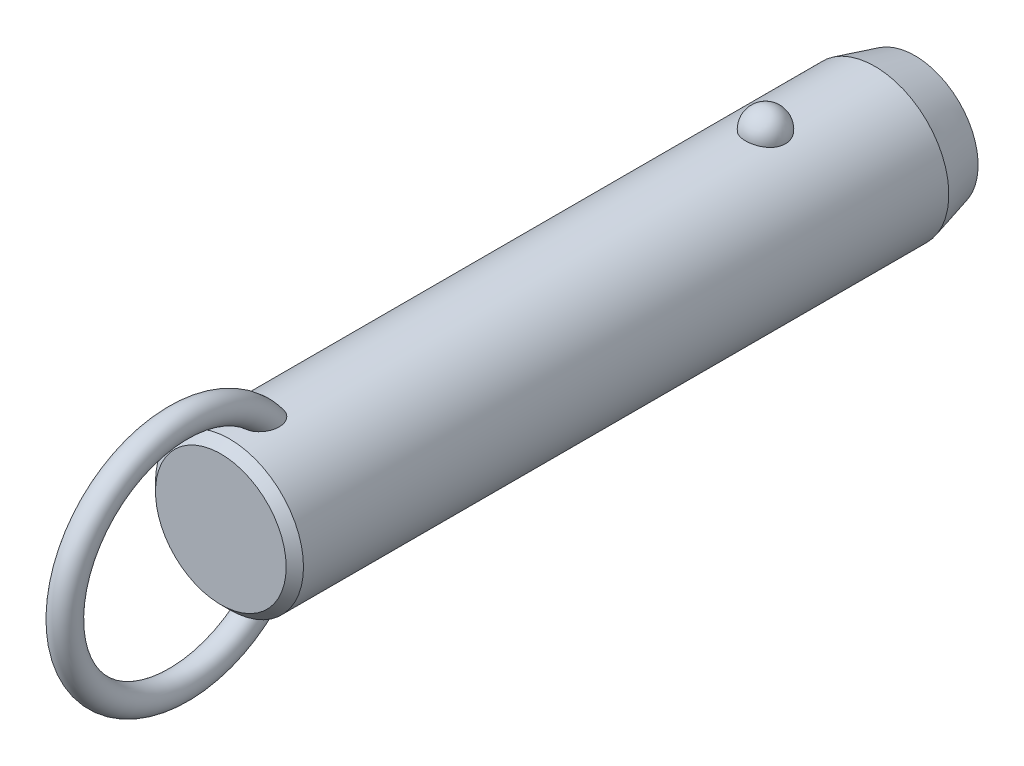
ISO-10303-21;
HEADER;
FILE_DESCRIPTION(('STEP AP214'),'2;1');
FILE_NAME('part.step','',(''),(''),'','','');
FILE_SCHEMA(('AUTOMOTIVE_DESIGN { 1 0 10303 214 1 1 1 1 }'));
ENDSEC;
DATA;
#1=APPLICATION_CONTEXT('core data for automotive mechanical design processes');
#2=APPLICATION_PROTOCOL_DEFINITION('international standard','automotive_design',2000,#1);
#3=PRODUCT_CONTEXT('',#1,'mechanical');
#4=PRODUCT('Part','Part','',(#3));
#5=PRODUCT_RELATED_PRODUCT_CATEGORY('part','',(#4));
#6=PRODUCT_DEFINITION_FORMATION('','',#4);
#7=PRODUCT_DEFINITION_CONTEXT('part definition',#1,'design');
#8=PRODUCT_DEFINITION('design','',#6,#7);
#9=PRODUCT_DEFINITION_SHAPE('','',#8);
#10=(LENGTH_UNIT() NAMED_UNIT(*) SI_UNIT(.MILLI.,.METRE.));
#11=(NAMED_UNIT(*) PLANE_ANGLE_UNIT() SI_UNIT($,.RADIAN.));
#12=(NAMED_UNIT(*) SI_UNIT($,.STERADIAN.) SOLID_ANGLE_UNIT());
#13=UNCERTAINTY_MEASURE_WITH_UNIT(LENGTH_MEASURE(1.E-05),#10,'distance_accuracy_value','');
#14=(GEOMETRIC_REPRESENTATION_CONTEXT(3) GLOBAL_UNCERTAINTY_ASSIGNED_CONTEXT((#13)) GLOBAL_UNIT_ASSIGNED_CONTEXT((#10,
#11,#12)) REPRESENTATION_CONTEXT('',''));
#15=CARTESIAN_POINT('',(0.,0.,0.));
#16=DIRECTION('',(0.,0.,1.));
#17=DIRECTION('',(1.,0.,0.));
#18=AXIS2_PLACEMENT_3D('',#15,#16,#17);
#19=CARTESIAN_POINT('',(0.,0.,66.));
#20=DIRECTION('',(0.,0.,-1.));
#21=DIRECTION('',(-1.,0.,0.));
#22=AXIS2_PLACEMENT_3D('',#19,#20,#21);
#23=CYLINDRICAL_SURFACE('',#22,11.1);
#24=CARTESIAN_POINT('',(2.9724815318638,10.6945945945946,-3.));
#25=CARTESIAN_POINT('',(2.97247830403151,10.6945972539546,-2.83225059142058));
#26=CARTESIAN_POINT('',(2.95876598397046,10.6984356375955,-2.66445972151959));
#27=CARTESIAN_POINT('',(2.90424529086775,10.7133624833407,-2.33362381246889));
#28=CARTESIAN_POINT('',(2.8634252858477,10.7244540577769,-2.1705808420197));
#29=CARTESIAN_POINT('',(2.75573657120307,10.7526272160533,-1.85396767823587));
#30=CARTESIAN_POINT('',(2.68887937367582,10.7697061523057,-1.70039333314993));
#31=CARTESIAN_POINT('',(2.53079696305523,10.8079438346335,-1.40691598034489));
#32=CARTESIAN_POINT('',(2.43957264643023,10.8291024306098,-1.2670124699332));
#33=CARTESIAN_POINT('',(2.23458150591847,10.8732541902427,-1.00409565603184));
#34=CARTESIAN_POINT('',(2.12071295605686,10.8962553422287,-0.881162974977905));
#35=CARTESIAN_POINT('',(1.87365402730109,10.9414421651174,-0.656352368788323));
#36=CARTESIAN_POINT('',(1.74046358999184,10.9636278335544,-0.554474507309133));
#37=CARTESIAN_POINT('',(1.45872188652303,11.0046495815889,-0.374872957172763));
#38=CARTESIAN_POINT('',(1.31021276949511,11.0234944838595,-0.297085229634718));
#39=CARTESIAN_POINT('',(1.00170030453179,11.0557957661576,-0.167529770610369));
#40=CARTESIAN_POINT('',(0.841698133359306,11.0692526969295,-0.115759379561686));
#41=CARTESIAN_POINT('',(0.517607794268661,11.0890932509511,-0.0403925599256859));
#42=CARTESIAN_POINT('',(0.353633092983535,11.0955916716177,-0.0163383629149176));
#43=CARTESIAN_POINT('',(0.0238420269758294,11.1011989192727,0.0044517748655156));
#44=CARTESIAN_POINT('',(-0.141974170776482,11.1003084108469,0.00119017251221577));
#45=CARTESIAN_POINT('',(-0.468405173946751,11.0912990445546,-0.0323233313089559));
#46=CARTESIAN_POINT('',(-0.629059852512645,11.0832767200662,-0.0622147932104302));
#47=CARTESIAN_POINT('',(-0.942937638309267,11.0609962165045,-0.147645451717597));
#48=CARTESIAN_POINT('',(-1.09616062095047,11.0467379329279,-0.203185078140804));
#49=CARTESIAN_POINT('',(-1.39181061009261,11.0134071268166,-0.3387529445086));
#50=CARTESIAN_POINT('',(-1.53417383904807,10.9943086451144,-0.418913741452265));
#51=CARTESIAN_POINT('',(-1.80342160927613,10.9533667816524,-0.60144882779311));
#52=CARTESIAN_POINT('',(-1.9303046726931,10.9315231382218,-0.703825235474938));
#53=CARTESIAN_POINT('',(-2.16747598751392,10.887005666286,-0.930091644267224));
#54=CARTESIAN_POINT('',(-2.27742774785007,10.8643239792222,-1.05433291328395));
#55=CARTESIAN_POINT('',(-2.47517316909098,10.8209886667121,-1.31966633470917));
#56=CARTESIAN_POINT('',(-2.56296538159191,10.8003351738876,-1.46075958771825));
#57=CARTESIAN_POINT('',(-2.71500300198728,10.7631304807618,-1.75753646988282));
#58=CARTESIAN_POINT('',(-2.77898901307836,10.7466250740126,-1.91335887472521));
#59=CARTESIAN_POINT('',(-2.88046189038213,10.7198747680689,-2.2339152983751));
#60=CARTESIAN_POINT('',(-2.91794947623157,10.709629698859,-2.39864907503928));
#61=CARTESIAN_POINT('',(-2.96537819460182,10.6965949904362,-2.73165170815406));
#62=CARTESIAN_POINT('',(-2.97542891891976,10.693775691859,-2.89990378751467));
#63=CARTESIAN_POINT('',(-2.96804271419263,10.6958279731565,-3.235752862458));
#64=CARTESIAN_POINT('',(-2.95060646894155,10.7006993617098,-3.40334987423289));
#65=CARTESIAN_POINT('',(-2.88883358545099,10.71753912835,-3.73233906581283));
#66=CARTESIAN_POINT('',(-2.84462026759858,10.7294749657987,-3.89375610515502));
#67=CARTESIAN_POINT('',(-2.73050447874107,10.7590797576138,-4.20667949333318));
#68=CARTESIAN_POINT('',(-2.66060103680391,10.7767489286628,-4.35818546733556));
#69=CARTESIAN_POINT('',(-2.49642559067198,10.8159599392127,-4.6478542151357));
#70=CARTESIAN_POINT('',(-2.40203047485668,10.8375211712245,-4.78594458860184));
#71=CARTESIAN_POINT('',(-2.19143488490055,10.8820570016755,-5.0441038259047));
#72=CARTESIAN_POINT('',(-2.07523364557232,10.9050316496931,-5.16417205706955));
#73=CARTESIAN_POINT('',(-1.82361254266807,10.9499219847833,-5.38334833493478));
#74=CARTESIAN_POINT('',(-1.68812945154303,10.9718338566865,-5.48238464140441));
#75=CARTESIAN_POINT('',(-1.40191298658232,11.0120611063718,-5.65618873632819));
#76=CARTESIAN_POINT('',(-1.25118062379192,11.0303767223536,-5.73095813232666));
#77=CARTESIAN_POINT('',(-0.940570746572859,11.0611653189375,-5.85334725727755));
#78=CARTESIAN_POINT('',(-0.780821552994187,11.0737044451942,-5.90127578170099));
#79=CARTESIAN_POINT('',(-0.455204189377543,11.0918598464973,-5.96992976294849));
#80=CARTESIAN_POINT('',(-0.289336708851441,11.0974768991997,-5.99065827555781));
#81=CARTESIAN_POINT('',(0.0406846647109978,11.1011307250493,-6.00418773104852));
#82=CARTESIAN_POINT('',(0.204817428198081,11.099299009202,-5.99747318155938));
#83=CARTESIAN_POINT('',(0.5295530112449,11.088551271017,-5.9574031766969));
#84=CARTESIAN_POINT('',(0.69015594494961,11.0796354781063,-5.92404858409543));
#85=CARTESIAN_POINT('',(1.0027760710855,11.0557204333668,-5.83180084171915));
#86=CARTESIAN_POINT('',(1.15482001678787,11.0407414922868,-5.77299291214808));
#87=CARTESIAN_POINT('',(1.44678373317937,11.0062913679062,-5.63147366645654));
#88=CARTESIAN_POINT('',(1.58670279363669,10.9868199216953,-5.54876095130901));
#89=CARTESIAN_POINT('',(1.8527023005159,10.9451315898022,-5.36027644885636));
#90=CARTESIAN_POINT('',(1.97855158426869,10.9228788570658,-5.25418644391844));
#91=CARTESIAN_POINT('',(2.21080872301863,10.8782509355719,-5.02251354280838));
#92=CARTESIAN_POINT('',(2.31721312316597,10.8558757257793,-4.89692718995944));
#93=CARTESIAN_POINT('',(2.5094551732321,10.8130715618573,-4.62745408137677));
#94=CARTESIAN_POINT('',(2.59493284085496,10.7926798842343,-4.48330448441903));
#95=CARTESIAN_POINT('',(2.740862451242,10.7565495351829,-4.18236358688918));
#96=CARTESIAN_POINT('',(2.80132490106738,10.7408089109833,-4.02557762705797));
#97=CARTESIAN_POINT('',(2.88959070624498,10.7173718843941,-3.72475308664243));
#98=CARTESIAN_POINT('',(2.92062102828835,10.7088950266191,-3.58171216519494));
#99=CARTESIAN_POINT('',(2.96206765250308,10.6975052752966,-3.29245795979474));
#100=CARTESIAN_POINT('',(2.97248434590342,10.6945922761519,-3.14624473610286));
#101=CARTESIAN_POINT('',(2.9724815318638,10.6945945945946,-3.));
#102=B_SPLINE_CURVE_WITH_KNOTS('',3,(#24,#25,#26,#27,#28,#29,#30,#31,#32,#33,#34,#35,#36,#37,
#38,#39,#40,#41,#42,#43,#44,#45,#46,#47,#48,#49,#50,#51,#52,#53,#54,#55,#56,#57,#58,#59,#60,#61,
#62,#63,#64,#65,#66,#67,#68,#69,#70,#71,#72,#73,#74,#75,#76,#77,#78,#79,#80,#81,#82,#83,#84,#85,
#86,#87,#88,#89,#90,#91,#92,#93,#94,#95,#96,#97,#98,#99,#100,#101),.UNSPECIFIED.,.T.,.F.,(4,2,2,
2,2,2,2,2,2,2,2,2,2,2,2,2,2,2,2,2,2,2,2,2,2,2,2,2,2,2,2,2,2,2,2,2,2,2,4),(0.,0.502722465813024,
1.00566079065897,1.5083769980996,2.01107471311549,2.51608392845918,3.02109467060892,
3.52475118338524,4.02835620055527,4.523518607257,5.0186364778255,5.50715297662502,
5.9956776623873,6.48688002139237,6.97812923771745,7.47814366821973,7.9781907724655,
8.48353712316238,8.9888697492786,9.49218093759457,9.99547960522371,10.4964777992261,
10.997494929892,11.5010810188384,12.0046847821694,12.5099796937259,13.0152411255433,
13.5145635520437,14.0138298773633,14.5043200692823,14.9947943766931,15.4836390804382,
15.9725123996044,16.4685040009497,16.9645836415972,17.4686765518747,17.972557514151,
18.410841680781,18.849117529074),.UNSPECIFIED.);
#103=CARTESIAN_POINT('',(2.9724815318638,10.6945945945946,-3.));
#104=VERTEX_POINT('',#103);
#105=EDGE_CURVE('E41',#104,#104,#102,.T.);
#106=ORIENTED_EDGE('',*,*,#105,.T.);
#107=EDGE_LOOP('',(#106));
#108=FACE_BOUND('',#107,.T.);
#109=CARTESIAN_POINT('',(0.,0.,77.4));
#110=DIRECTION('',(0.,0.,1.));
#111=DIRECTION('',(1.,0.,0.));
#112=AXIS2_PLACEMENT_3D('',#109,#110,#111);
#113=CIRCLE('',#112,11.1);
#114=CARTESIAN_POINT('',(11.1,0.,77.4));
#115=VERTEX_POINT('',#114);
#116=EDGE_CURVE('E10',#115,#115,#113,.F.);
#117=ORIENTED_EDGE('',*,*,#116,.T.);
#118=EDGE_LOOP('',(#117));
#119=FACE_BOUND('',#118,.T.);
#120=CARTESIAN_POINT('',(-0.564520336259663,-11.0856356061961,69.6578154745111));
#121=CARTESIAN_POINT('',(-0.667202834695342,-11.0804062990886,69.6912839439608));
#122=CARTESIAN_POINT('',(-0.766875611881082,-11.0738877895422,69.7338357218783));
#123=CARTESIAN_POINT('',(-0.957284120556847,-11.0590576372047,69.8354190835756));
#124=CARTESIAN_POINT('',(-1.04801616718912,-11.0507452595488,69.8944574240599));
#125=CARTESIAN_POINT('',(-1.21800952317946,-11.0333016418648,70.0265293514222));
#126=CARTESIAN_POINT('',(-1.29730805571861,-11.0241732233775,70.0995156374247));
#127=CARTESIAN_POINT('',(-1.44337665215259,-11.0060026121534,70.2570374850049));
#128=CARTESIAN_POINT('',(-1.51014622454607,-10.9969604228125,70.3415734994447));
#129=CARTESIAN_POINT('',(-1.63454620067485,-10.9791841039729,70.5255213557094));
#130=CARTESIAN_POINT('',(-1.69127003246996,-10.9705107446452,70.6255493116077));
#131=CARTESIAN_POINT('',(-1.78980785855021,-10.9548648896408,70.8327902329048));
#132=CARTESIAN_POINT('',(-1.83161214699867,-10.9478935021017,70.9400078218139));
#133=CARTESIAN_POINT('',(-1.91557028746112,-10.9335803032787,71.2054080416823));
#134=CARTESIAN_POINT('',(-1.95040620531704,-10.9273269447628,71.3659806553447));
#135=CARTESIAN_POINT('',(-1.99388326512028,-10.9194709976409,71.6906977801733));
#136=CARTESIAN_POINT('',(-2.00248051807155,-10.9178762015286,71.8548478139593));
#137=CARTESIAN_POINT('',(-1.99551615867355,-10.9191578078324,72.2246504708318));
#138=CARTESIAN_POINT('',(-1.9732206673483,-10.9232807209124,72.4301911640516));
#139=CARTESIAN_POINT('',(-1.91529761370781,-10.9335244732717,72.733595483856));
#140=CARTESIAN_POINT('',(-1.8918457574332,-10.9376266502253,72.8340883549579));
#141=CARTESIAN_POINT('',(-1.83700674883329,-10.9469720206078,73.032855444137));
#142=CARTESIAN_POINT('',(-1.80562070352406,-10.9522150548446,73.1311299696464));
#143=CARTESIAN_POINT('',(-1.73463055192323,-10.9636837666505,73.3259148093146));
#144=CARTESIAN_POINT('',(-1.69493416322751,-10.9699202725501,73.4223907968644));
#145=CARTESIAN_POINT('',(-1.60745141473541,-10.9830806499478,73.6116262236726));
#146=CARTESIAN_POINT('',(-1.55966150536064,-10.9900048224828,73.7043840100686));
#147=CARTESIAN_POINT('',(-1.45591812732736,-11.0042280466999,73.8846907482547));
#148=CARTESIAN_POINT('',(-1.40000013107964,-11.0115253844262,73.9722601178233));
#149=CARTESIAN_POINT('',(-1.27937470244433,-11.0261911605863,74.1410298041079));
#150=CARTESIAN_POINT('',(-1.21467835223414,-11.0335594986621,74.2222379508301));
#151=CARTESIAN_POINT('',(-1.08218150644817,-11.0473027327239,74.3690010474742));
#152=CARTESIAN_POINT('',(-1.01522633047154,-11.0537063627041,74.435309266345));
#153=CARTESIAN_POINT('',(-0.87295215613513,-11.065850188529,74.5583780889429));
#154=CARTESIAN_POINT('',(-0.797642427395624,-11.0715911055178,74.6151491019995));
#155=CARTESIAN_POINT('',(-0.651396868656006,-11.081071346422,74.7075155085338));
#156=CARTESIAN_POINT('',(-0.581712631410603,-11.0849841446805,74.7450491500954));
#157=CARTESIAN_POINT('',(-0.437066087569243,-11.0916271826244,74.8082594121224));
#158=CARTESIAN_POINT('',(-0.362109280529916,-11.0943586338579,74.8339481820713));
#159=CARTESIAN_POINT('',(-0.207828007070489,-11.0983242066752,74.871117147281));
#160=CARTESIAN_POINT('',(-0.128467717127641,-11.0995432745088,74.8824545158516));
#161=CARTESIAN_POINT('',(0.0309101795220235,-11.1002423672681,74.8889658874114));
#162=CARTESIAN_POINT('',(0.110927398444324,-11.0997233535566,74.8841488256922));
#163=CARTESIAN_POINT('',(0.256406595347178,-11.097240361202,74.8609599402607));
#164=CARTESIAN_POINT('',(0.32223577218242,-11.0955074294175,74.8447543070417));
#165=CARTESIAN_POINT('',(0.450635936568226,-11.0910350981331,74.8026008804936));
#166=CARTESIAN_POINT('',(0.513205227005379,-11.0882951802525,74.7766480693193));
#167=CARTESIAN_POINT('',(0.662626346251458,-11.0805620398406,74.7026073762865));
#168=CARTESIAN_POINT('',(0.747127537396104,-11.0751144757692,74.6498452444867));
#169=CARTESIAN_POINT('',(0.906756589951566,-11.0631932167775,74.5317206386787));
#170=CARTESIAN_POINT('',(0.981859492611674,-11.0567168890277,74.4663257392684));
#171=CARTESIAN_POINT('',(1.10712207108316,-11.0447856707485,74.3422633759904));
#172=CARTESIAN_POINT('',(1.15909566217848,-11.0394280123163,74.2853831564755));
#173=CARTESIAN_POINT('',(1.25791923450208,-11.0286040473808,74.1673271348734));
#174=CARTESIAN_POINT('',(1.30476642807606,-11.0231376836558,74.1061490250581));
#175=CARTESIAN_POINT('',(1.43818612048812,-11.0068027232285,73.9173051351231));
#176=CARTESIAN_POINT('',(1.51751767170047,-10.9960104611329,73.7844531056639));
#177=CARTESIAN_POINT('',(1.63597546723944,-10.9788847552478,73.5531371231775));
#178=CARTESIAN_POINT('',(1.67988876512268,-10.9722190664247,73.4570530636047));
#179=CARTESIAN_POINT('',(1.75953241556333,-10.9597298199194,73.2614311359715));
#180=CARTESIAN_POINT('',(1.79525967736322,-10.9539065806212,73.1618919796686));
#181=CARTESIAN_POINT('',(1.85844731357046,-10.9433632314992,72.9602111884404));
#182=CARTESIAN_POINT('',(1.88591073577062,-10.9386427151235,72.8580705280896));
#183=CARTESIAN_POINT('',(1.93234324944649,-10.9305350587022,72.6518191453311));
#184=CARTESIAN_POINT('',(1.95131065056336,-10.9271481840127,72.5477080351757));
#185=CARTESIAN_POINT('',(1.99040203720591,-10.9201183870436,72.2654588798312));
#186=CARTESIAN_POINT('',(2.00221217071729,-10.9179256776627,72.0860370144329));
#187=CARTESIAN_POINT('',(1.99711676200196,-10.9188636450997,71.7277133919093));
#188=CARTESIAN_POINT('',(1.98026150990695,-10.9219849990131,71.548811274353));
#189=CARTESIAN_POINT('',(1.92151657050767,-10.9324473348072,71.2364514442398));
#190=CARTESIAN_POINT('',(1.88605081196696,-10.9386915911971,71.1017594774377));
#191=CARTESIAN_POINT('',(1.7939302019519,-10.9541780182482,70.8399669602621));
#192=CARTESIAN_POINT('',(1.73729868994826,-10.9634168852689,70.7128582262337));
#193=CARTESIAN_POINT('',(1.612370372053,-10.9824218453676,70.4894184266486));
#194=CARTESIAN_POINT('',(1.54715374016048,-10.9918945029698,70.3913455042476));
#195=CARTESIAN_POINT('',(1.40127026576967,-11.0114415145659,70.2074341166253));
#196=CARTESIAN_POINT('',(1.32060742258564,-11.0215157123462,70.1215924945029));
#197=CARTESIAN_POINT('',(1.14474787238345,-11.041168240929,69.9651630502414));
#198=CARTESIAN_POINT('',(1.04947805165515,-11.0507437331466,69.8946565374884));
#199=CARTESIAN_POINT('',(0.847278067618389,-11.0680789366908,69.772640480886));
#200=CARTESIAN_POINT('',(0.740351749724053,-11.0758392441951,69.7211246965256));
#201=CARTESIAN_POINT('',(0.529289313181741,-11.0878275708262,69.6434852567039));
#202=CARTESIAN_POINT('',(0.425895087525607,-11.0923259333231,69.615377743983));
#203=CARTESIAN_POINT('',(0.215723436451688,-11.0984001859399,69.5777038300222));
#204=CARTESIAN_POINT('',(0.108947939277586,-11.0999777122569,69.5681270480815));
#205=CARTESIAN_POINT('',(-0.0938962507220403,-11.1000196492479,69.5678773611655));
#206=CARTESIAN_POINT('',(-0.189967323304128,-11.0987797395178,69.5754089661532));
#207=CARTESIAN_POINT('',(-0.379657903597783,-11.0939111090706,69.6055079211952));
#208=CARTESIAN_POINT('',(-0.473277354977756,-11.0902823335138,69.6280756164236));
#209=CARTESIAN_POINT('',(-0.564520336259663,-11.0856356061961,69.6578154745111));
#210=B_SPLINE_CURVE_WITH_KNOTS('',3,(#120,#121,#122,#123,#124,#125,#126,#127,#128,#129,#130,
#131,#132,#133,#134,#135,#136,#137,#138,#139,#140,#141,#142,#143,#144,#145,#146,#147,#148,#149,
#150,#151,#152,#153,#154,#155,#156,#157,#158,#159,#160,#161,#162,#163,#164,#165,#166,#167,#168,
#169,#170,#171,#172,#173,#174,#175,#176,#177,#178,#179,#180,#181,#182,#183,#184,#185,#186,#187,
#188,#189,#190,#191,#192,#193,#194,#195,#196,#197,#198,#199,#200,#201,#202,#203,#204,#205,#206,
#207,#208,#209),.UNSPECIFIED.,.T.,.F.,(4,2,2,2,2,2,2,2,2,2,2,2,2,2,2,2,2,2,2,2,2,2,2,2,2,2,2,2,
2,2,2,2,2,2,2,2,2,2,2,2,2,2,2,2,4),(0.,0.323999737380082,0.648132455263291,0.971184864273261,
1.29424994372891,1.6388623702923,1.98369857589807,2.47426059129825,2.96564271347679,
3.58257396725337,3.89215258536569,4.20168803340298,4.51486273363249,4.82817514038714,
5.14015911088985,5.45175282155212,5.73442856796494,6.01679375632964,6.25364580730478,
6.49025437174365,6.7291996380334,6.96801276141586,7.17061258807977,7.37331685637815,
7.67094989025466,7.96935728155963,8.2007506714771,8.43226927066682,8.89581623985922,
9.21306533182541,9.53043400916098,9.84768549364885,10.1650000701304,10.70229304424,
11.2386443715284,11.6553390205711,12.0715755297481,12.4245637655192,12.7774607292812,
13.1321855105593,13.4867936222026,13.8068771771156,14.1267813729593,14.4146787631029,
14.7025827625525),.UNSPECIFIED.);
#211=CARTESIAN_POINT('',(-0.564520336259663,-11.0856356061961,69.6578154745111));
#212=VERTEX_POINT('',#211);
#213=EDGE_CURVE('E59',#212,#212,#210,.T.);
#214=ORIENTED_EDGE('',*,*,#213,.T.);
#215=EDGE_LOOP('',(#214));
#216=FACE_BOUND('',#215,.T.);
#217=CARTESIAN_POINT('',(-0.564520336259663,11.0856356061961,69.6578154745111));
#218=CARTESIAN_POINT('',(-0.468542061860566,11.0905203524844,69.6265456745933));
#219=CARTESIAN_POINT('',(-0.36979381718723,11.0942886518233,69.6031576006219));
#220=CARTESIAN_POINT('',(-0.169555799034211,11.0991586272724,69.5730858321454));
#221=CARTESIAN_POINT('',(-0.0680604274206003,11.1002543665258,69.5664393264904));
#222=CARTESIAN_POINT('',(0.134549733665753,11.099646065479,69.5701579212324));
#223=CARTESIAN_POINT('',(0.235664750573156,11.0979441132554,69.5805103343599));
#224=CARTESIAN_POINT('',(0.43463240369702,11.0919342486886,69.6178318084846));
#225=CARTESIAN_POINT('',(0.532486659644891,11.0876276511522,69.6447924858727));
#226=CARTESIAN_POINT('',(0.722445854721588,11.0768742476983,69.7144096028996));
#227=CARTESIAN_POINT('',(0.814543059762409,11.0704246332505,69.7570866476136));
#228=CARTESIAN_POINT('',(0.99056508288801,11.0560659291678,69.8566487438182));
#229=CARTESIAN_POINT('',(1.07448844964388,11.048156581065,69.9135363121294));
#230=CARTESIAN_POINT('',(1.23562672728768,11.0313221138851,70.0422106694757));
#231=CARTESIAN_POINT('',(1.31242684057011,11.0223686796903,70.1145117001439));
#232=CARTESIAN_POINT('',(1.45398030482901,11.0045918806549,70.2700425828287));
#233=CARTESIAN_POINT('',(1.51873073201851,10.9957685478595,70.3532750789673));
#234=CARTESIAN_POINT('',(1.64107232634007,10.9782087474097,70.5363842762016));
#235=CARTESIAN_POINT('',(1.69743176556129,10.9695572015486,70.6370893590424));
#236=CARTESIAN_POINT('',(1.79515063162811,10.9539887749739,70.8456264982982));
#237=CARTESIAN_POINT('',(1.83649966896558,10.9470730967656,70.9534634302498));
#238=CARTESIAN_POINT('',(1.91931148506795,10.9329211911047,71.2203995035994));
#239=CARTESIAN_POINT('',(1.9534010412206,10.9267904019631,71.3818612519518));
#240=CARTESIAN_POINT('',(1.99526195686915,10.9192174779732,71.7082163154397));
#241=CARTESIAN_POINT('',(2.00298989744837,10.9177830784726,71.8731148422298));
#242=CARTESIAN_POINT('',(1.99396251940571,10.9194420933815,72.2441006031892));
#243=CARTESIAN_POINT('',(1.97050829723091,10.923774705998,72.4500387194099));
#244=CARTESIAN_POINT('',(1.91079643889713,10.9343131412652,72.7539019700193));
#245=CARTESIAN_POINT('',(1.88673702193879,10.9385106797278,72.8545296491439));
#246=CARTESIAN_POINT('',(1.83065508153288,10.9480376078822,73.0535107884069));
#247=CARTESIAN_POINT('',(1.79863369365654,10.9533668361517,73.151864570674));
#248=CARTESIAN_POINT('',(1.72633365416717,10.9649954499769,73.346720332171));
#249=CARTESIAN_POINT('',(1.68596409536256,10.9713053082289,73.4431879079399));
#250=CARTESIAN_POINT('',(1.59707998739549,10.9845964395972,73.6323233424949));
#251=CARTESIAN_POINT('',(1.54856169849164,10.9915780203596,73.7249894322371));
#252=CARTESIAN_POINT('',(1.44330168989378,11.0058935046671,73.9049752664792));
#253=CARTESIAN_POINT('',(1.38659749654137,11.0132257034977,73.992316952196));
#254=CARTESIAN_POINT('',(1.26431158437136,11.0279330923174,74.1604563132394));
#255=CARTESIAN_POINT('',(1.19874160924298,11.0353082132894,74.2412624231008));
#256=CARTESIAN_POINT('',(1.06542088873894,11.048931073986,74.3859856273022));
#257=CARTESIAN_POINT('',(0.998640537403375,11.0552153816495,74.450784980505));
#258=CARTESIAN_POINT('',(0.856896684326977,11.0671032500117,74.5708462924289));
#259=CARTESIAN_POINT('',(0.781942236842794,11.0727075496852,74.6261186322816));
#260=CARTESIAN_POINT('',(0.636276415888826,11.081949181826,74.7159721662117));
#261=CARTESIAN_POINT('',(0.566755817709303,11.0857572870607,74.7524410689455));
#262=CARTESIAN_POINT('',(0.422602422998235,11.0921860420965,74.8135333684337));
#263=CARTESIAN_POINT('',(0.347974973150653,11.0948079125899,74.8381689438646));
#264=CARTESIAN_POINT('',(0.194593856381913,11.0985608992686,74.8733233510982));
#265=CARTESIAN_POINT('',(0.115807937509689,11.0996777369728,74.8837069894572));
#266=CARTESIAN_POINT('',(-0.0422499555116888,11.1002003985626,74.8885747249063));
#267=CARTESIAN_POINT('',(-0.121521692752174,11.09960699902,74.883066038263));
#268=CARTESIAN_POINT('',(-0.266046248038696,11.0970123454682,74.8588271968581));
#269=CARTESIAN_POINT('',(-0.331661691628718,11.0952283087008,74.8421356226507));
#270=CARTESIAN_POINT('',(-0.459588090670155,11.0906663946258,74.7991117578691));
#271=CARTESIAN_POINT('',(-0.521897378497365,11.0878880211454,74.772774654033));
#272=CARTESIAN_POINT('',(-0.671446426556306,11.0800342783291,74.6975130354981));
#273=CARTESIAN_POINT('',(-0.756250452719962,11.0744969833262,74.6438182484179));
#274=CARTESIAN_POINT('',(-0.916349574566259,11.0624045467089,74.5238029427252));
#275=CARTESIAN_POINT('',(-0.991618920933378,11.0558467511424,74.4574493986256));
#276=CARTESIAN_POINT('',(-1.11713140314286,11.0437783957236,74.3316335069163));
#277=CARTESIAN_POINT('',(-1.16920539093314,11.0383619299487,74.2739524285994));
#278=CARTESIAN_POINT('',(-1.26817476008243,11.02743010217,74.1542809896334));
#279=CARTESIAN_POINT('',(-1.31506731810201,11.0219146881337,74.0922883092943));
#280=CARTESIAN_POINT('',(-1.40399813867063,11.0109399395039,73.9647843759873));
#281=CARTESIAN_POINT('',(-1.4460286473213,11.0054807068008,73.8992677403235));
#282=CARTESIAN_POINT('',(-1.52538779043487,10.9947621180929,73.7654223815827));
#283=CARTESIAN_POINT('',(-1.56271516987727,10.9895028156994,73.6970929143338));
#284=CARTESIAN_POINT('',(-1.64537943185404,10.9774790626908,73.5332101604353));
#285=CARTESIAN_POINT('',(-1.68879497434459,10.9708503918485,73.4366735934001));
#286=CARTESIAN_POINT('',(-1.76740738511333,10.9584602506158,73.2402369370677));
#287=CARTESIAN_POINT('',(-1.80260120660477,10.95269910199,73.1403356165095));
#288=CARTESIAN_POINT('',(-1.86468657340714,10.9423003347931,72.9379663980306));
#289=CARTESIAN_POINT('',(-1.8915816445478,10.9376622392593,72.8354996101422));
#290=CARTESIAN_POINT('',(-1.93682458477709,10.9297405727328,72.6286429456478));
#291=CARTESIAN_POINT('',(-1.9551708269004,10.9264572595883,72.5242527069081));
#292=CARTESIAN_POINT('',(-1.99232562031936,10.9197647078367,72.2426287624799));
#293=CARTESIAN_POINT('',(-2.00294603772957,10.9177914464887,72.0641857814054));
#294=CARTESIAN_POINT('',(-1.99566675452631,10.9191290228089,71.7079962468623));
#295=CARTESIAN_POINT('',(-1.97781651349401,10.9224306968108,71.5302490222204));
#296=CARTESIAN_POINT('',(-1.91747214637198,10.9331592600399,71.2197921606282));
#297=CARTESIAN_POINT('',(-1.88131022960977,10.9395108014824,71.085825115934));
#298=CARTESIAN_POINT('',(-1.7879038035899,10.9551659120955,70.8255975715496));
#299=CARTESIAN_POINT('',(-1.7306830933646,10.9644661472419,70.6993285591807));
#300=CARTESIAN_POINT('',(-1.60475573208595,10.9835398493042,70.4774156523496));
#301=CARTESIAN_POINT('',(-1.53908879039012,10.9930297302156,70.3800265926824));
#302=CARTESIAN_POINT('',(-1.39238608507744,11.0125708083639,70.1975250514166));
#303=CARTESIAN_POINT('',(-1.31135150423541,11.0226219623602,70.1124116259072));
#304=CARTESIAN_POINT('',(-1.14382035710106,11.0411991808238,69.9652994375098));
#305=CARTESIAN_POINT('',(-1.05858500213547,11.0497792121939,69.9018693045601));
#306=CARTESIAN_POINT('',(-0.878723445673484,11.0655285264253,69.7902505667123));
#307=CARTESIAN_POINT('',(-0.784123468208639,11.0727015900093,69.7420208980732));
#308=CARTESIAN_POINT('',(-0.646163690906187,11.0812501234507,69.686023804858));
#309=CARTESIAN_POINT('',(-0.605595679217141,11.0835451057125,69.6711978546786));
#310=CARTESIAN_POINT('',(-0.564520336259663,11.0856356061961,69.6578154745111));
#311=B_SPLINE_CURVE_WITH_KNOTS('',3,(#217,#218,#219,#220,#221,#222,#223,#224,#225,#226,#227,
#228,#229,#230,#231,#232,#233,#234,#235,#236,#237,#238,#239,#240,#241,#242,#243,#244,#245,#246,
#247,#248,#249,#250,#251,#252,#253,#254,#255,#256,#257,#258,#259,#260,#261,#262,#263,#264,#265,
#266,#267,#268,#269,#270,#271,#272,#273,#274,#275,#276,#277,#278,#279,#280,#281,#282,#283,#284,
#285,#286,#287,#288,#289,#290,#291,#292,#293,#294,#295,#296,#297,#298,#299,#300,#301,#302,#303,
#304,#305,#306,#307,#308,#309,#310),.UNSPECIFIED.,.T.,.F.,(4,2,2,2,2,2,2,2,2,2,2,2,2,2,2,2,2,2,
2,2,2,2,2,2,2,2,2,2,2,2,2,2,2,2,2,2,2,2,2,2,2,2,2,2,2,2,4),(0.,0.303061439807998,
0.606795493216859,0.910302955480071,1.21365733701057,1.51741085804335,1.82121821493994,
2.13745205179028,2.45376252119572,2.79958678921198,3.14564996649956,3.63832391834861,
4.13180893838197,4.75031912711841,5.06071926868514,5.37107516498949,5.68500772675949,
5.99908475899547,6.31176519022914,6.62403542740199,6.90315673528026,7.1819719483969,
7.41687778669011,7.65154134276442,7.88841587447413,8.12518286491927,8.3275284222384,
8.52997509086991,8.82986421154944,9.13054668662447,9.36393502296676,9.59744991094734,
9.83133221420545,10.0652767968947,10.383032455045,10.7009056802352,11.0186436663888,
11.3364420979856,11.8705925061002,12.4038159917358,12.8189662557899,13.2336487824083,
13.5857049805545,13.9377340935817,14.2561354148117,14.5736690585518,14.7033687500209),.UNSPECIFIED.);
#312=CARTESIAN_POINT('',(-0.564520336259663,11.0856356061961,69.6578154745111));
#313=VERTEX_POINT('',#312);
#314=EDGE_CURVE('E66',#313,#313,#311,.T.);
#315=ORIENTED_EDGE('',*,*,#314,.T.);
#316=EDGE_LOOP('',(#315));
#317=FACE_BOUND('',#316,.T.);
#318=CARTESIAN_POINT('',(0.,0.,-19.3999999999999));
#319=DIRECTION('',(0.,0.,-1.));
#320=DIRECTION('',(-1.,0.,0.));
#321=AXIS2_PLACEMENT_3D('',#318,#319,#320);
#322=CIRCLE('',#321,11.1);
#323=CARTESIAN_POINT('',(-11.1,0.,-19.3999999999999));
#324=VERTEX_POINT('',#323);
#325=EDGE_CURVE('E56',#324,#324,#322,.F.);
#326=ORIENTED_EDGE('',*,*,#325,.T.);
#327=EDGE_LOOP('',(#326));
#328=FACE_BOUND('',#327,.T.);
#329=ADVANCED_FACE('F37',(#108,#119,#216,#317,#328),#23,.T.);
#330=CARTESIAN_POINT('',(0.,0.,-25.4));
#331=DIRECTION('',(0.,0.,-1.));
#332=DIRECTION('',(-1.,0.,0.));
#333=AXIS2_PLACEMENT_3D('',#330,#331,#332);
#334=PLANE('',#333);
#335=CARTESIAN_POINT('',(0.,0.,-25.4));
#336=DIRECTION('',(0.,0.,-1.));
#337=DIRECTION('',(-1.,0.,0.));
#338=AXIS2_PLACEMENT_3D('',#335,#336,#337);
#339=CIRCLE('',#338,9.49230484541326);
#340=CARTESIAN_POINT('',(-9.49230484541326,0.,-25.4));
#341=VERTEX_POINT('',#340);
#342=EDGE_CURVE('E65',#341,#341,#339,.T.);
#343=ORIENTED_EDGE('',*,*,#342,.T.);
#344=EDGE_LOOP('',(#343));
#345=FACE_BOUND('',#344,.T.);
#346=ADVANCED_FACE('F84',(#345),#334,.T.);
#347=CARTESIAN_POINT('',(0.,0.,-25.4));
#348=DIRECTION('',(0.,0.,1.));
#349=DIRECTION('',(1.,0.,0.));
#350=AXIS2_PLACEMENT_3D('',#347,#348,#349);
#351=CONICAL_SURFACE('',#350,9.49230484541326,0.261799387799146);
#352=ORIENTED_EDGE('',*,*,#325,.F.);
#353=EDGE_LOOP('',(#352));
#354=FACE_BOUND('',#353,.T.);
#355=ORIENTED_EDGE('',*,*,#342,.F.);
#356=EDGE_LOOP('',(#355));
#357=FACE_BOUND('',#356,.T.);
#358=ADVANCED_FACE('F82',(#354,#357),#351,.T.);
#359=CARTESIAN_POINT('',(0.,0.,78.7));
#360=DIRECTION('',(0.,0.,1.));
#361=DIRECTION('',(1.,0.,0.));
#362=AXIS2_PLACEMENT_3D('',#359,#360,#361);
#363=PLANE('',#362);
#364=CARTESIAN_POINT('',(0.,0.,78.7));
#365=DIRECTION('',(0.,0.,1.));
#366=DIRECTION('',(1.,0.,0.));
#367=AXIS2_PLACEMENT_3D('',#364,#365,#366);
#368=CIRCLE('',#367,9.79999999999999);
#369=CARTESIAN_POINT('',(9.79999999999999,0.,78.7));
#370=VERTEX_POINT('',#369);
#371=EDGE_CURVE('E50',#370,#370,#368,.T.);
#372=ORIENTED_EDGE('',*,*,#371,.T.);
#373=EDGE_LOOP('',(#372));
#374=FACE_BOUND('',#373,.T.);
#375=ADVANCED_FACE('F76',(#374),#363,.T.);
#376=CARTESIAN_POINT('',(0.,0.,85.05));
#377=DIRECTION('',(1.,0.,0.));
#378=DIRECTION('',(0.,0.,-1.));
#379=AXIS2_PLACEMENT_3D('',#376,#377,#378);
#380=TOROIDAL_SURFACE('',#379,17.05,2.);
#381=ORIENTED_EDGE('',*,*,#314,.F.);
#382=EDGE_LOOP('',(#381));
#383=FACE_BOUND('',#382,.T.);
#384=ORIENTED_EDGE('',*,*,#213,.F.);
#385=EDGE_LOOP('',(#384));
#386=FACE_BOUND('',#385,.T.);
#387=ADVANCED_FACE('F72',(#383,#386),#380,.T.);
#388=CARTESIAN_POINT('',(0.,0.,78.7));
#389=DIRECTION('',(0.,0.,-1.));
#390=DIRECTION('',(-1.,0.,0.));
#391=AXIS2_PLACEMENT_3D('',#388,#389,#390);
#392=CONICAL_SURFACE('',#391,9.79999999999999,0.785398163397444);
#393=ORIENTED_EDGE('',*,*,#116,.F.);
#394=EDGE_LOOP('',(#393));
#395=FACE_BOUND('',#394,.T.);
#396=ORIENTED_EDGE('',*,*,#371,.F.);
#397=EDGE_LOOP('',(#396));
#398=FACE_BOUND('',#397,.T.);
#399=ADVANCED_FACE('F39',(#395,#398),#392,.T.);
#400=CARTESIAN_POINT('',(0.,11.1,-3.));
#401=DIRECTION('',(0.,1.,0.));
#402=DIRECTION('',(0.,0.,-1.));
#403=AXIS2_PLACEMENT_3D('',#400,#401,#402);
#404=SPHERICAL_SURFACE('',#403,3.);
#405=ORIENTED_EDGE('',*,*,#105,.F.);
#406=EDGE_LOOP('',(#405));
#407=FACE_BOUND('',#406,.T.);
#408=ADVANCED_FACE('F78',(#407),#404,.T.);
#409=CLOSED_SHELL('',(#329,#346,#358,#375,#387,#399,#408));
#410=MANIFOLD_SOLID_BREP('B2',#409);
#411=ADVANCED_BREP_SHAPE_REPRESENTATION('',(#18,#410),#14);
#412=SHAPE_DEFINITION_REPRESENTATION(#9,#411);
ENDSEC;
END-ISO-10303-21;
